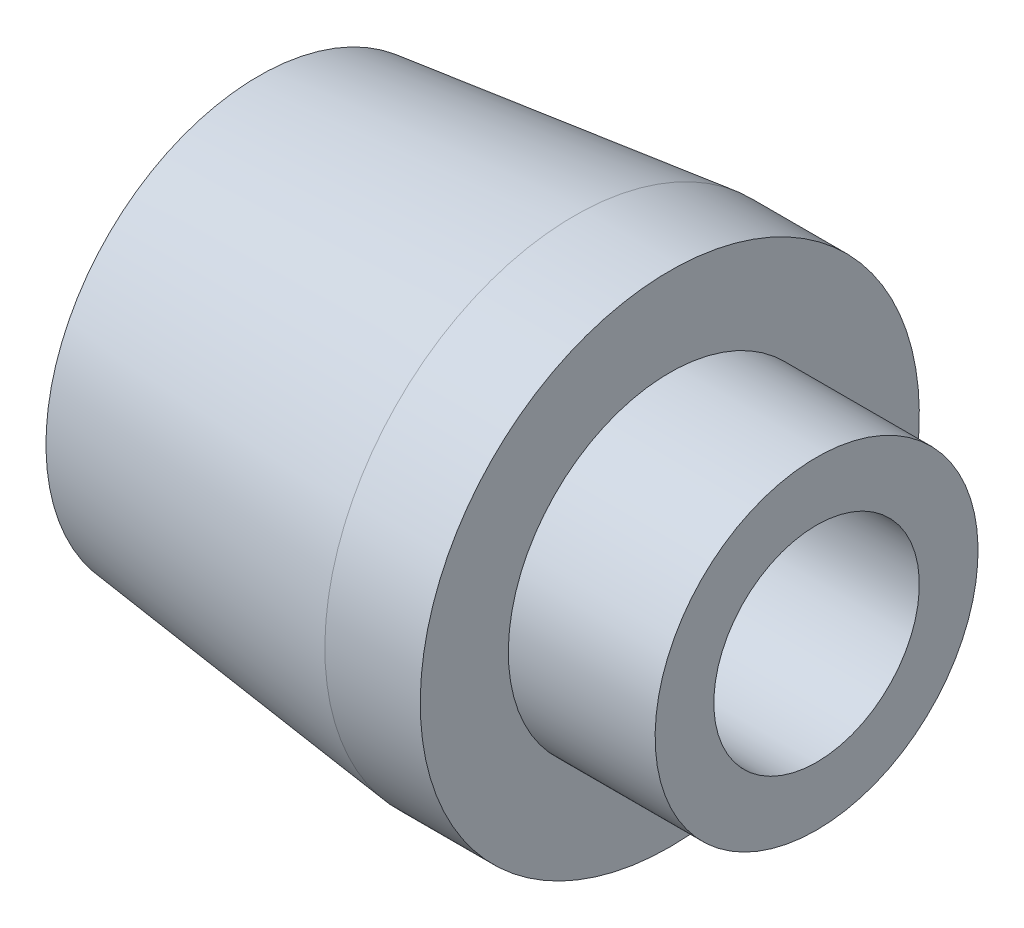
from build123d import *


with BuildPart() as part:
    # Esquisse1 → Base-R_volution (revolve)
    with BuildSketch(Plane.XY, mode=Mode.PRIVATE) as base_r_volution_sk:
        Polygon((10, 11), (0, 11), (0, 17), (-6.5, 17), (-28, 14.5), (-28, 7), (10, 7), align=None)
    revolve(base_r_volution_sk.sketch.rotate(Axis((-90, 0, 0), (1, 0, 0)), 180), axis=Axis((-90, 0, 0), (1, 0, 0)))


solid = part.part
